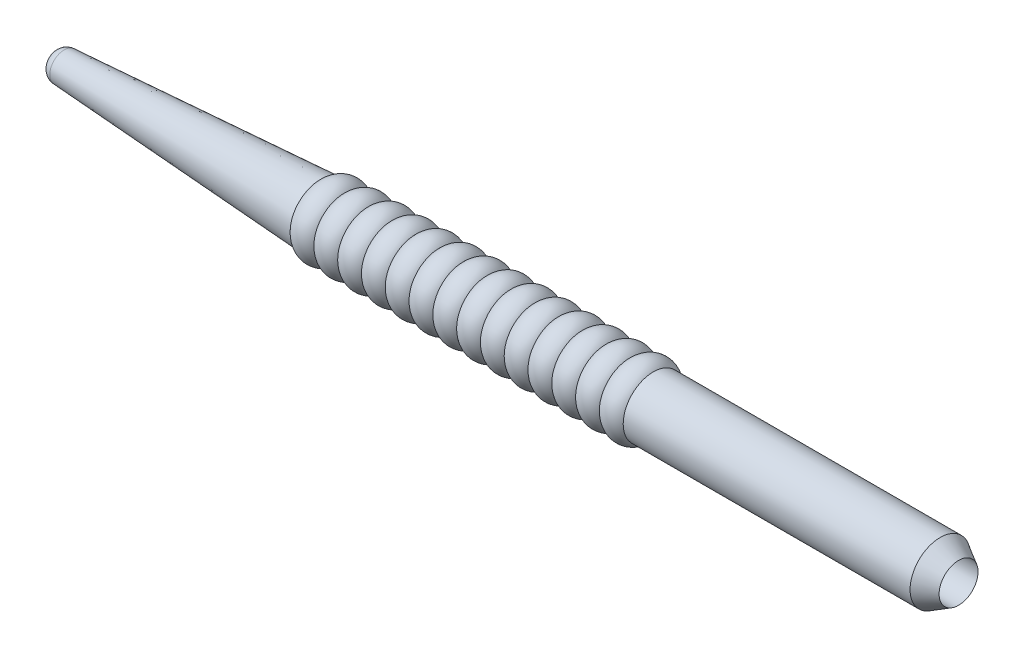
ISO-10303-21;
HEADER;
FILE_DESCRIPTION(('STEP AP214'),'2;1');
FILE_NAME('part.step','',(''),(''),'','','');
FILE_SCHEMA(('AUTOMOTIVE_DESIGN { 1 0 10303 214 1 1 1 1 }'));
ENDSEC;
DATA;
#1=APPLICATION_CONTEXT('core data for automotive mechanical design processes');
#2=APPLICATION_PROTOCOL_DEFINITION('international standard','automotive_design',2000,#1);
#3=PRODUCT_CONTEXT('',#1,'mechanical');
#4=PRODUCT('Part','Part','',(#3));
#5=PRODUCT_RELATED_PRODUCT_CATEGORY('part','',(#4));
#6=PRODUCT_DEFINITION_FORMATION('','',#4);
#7=PRODUCT_DEFINITION_CONTEXT('part definition',#1,'design');
#8=PRODUCT_DEFINITION('design','',#6,#7);
#9=PRODUCT_DEFINITION_SHAPE('','',#8);
#10=(LENGTH_UNIT() NAMED_UNIT(*) SI_UNIT(.MILLI.,.METRE.));
#11=(NAMED_UNIT(*) PLANE_ANGLE_UNIT() SI_UNIT($,.RADIAN.));
#12=(NAMED_UNIT(*) SI_UNIT($,.STERADIAN.) SOLID_ANGLE_UNIT());
#13=UNCERTAINTY_MEASURE_WITH_UNIT(LENGTH_MEASURE(1.E-05),#10,'distance_accuracy_value','');
#14=(GEOMETRIC_REPRESENTATION_CONTEXT(3) GLOBAL_UNCERTAINTY_ASSIGNED_CONTEXT((#13)) GLOBAL_UNIT_ASSIGNED_CONTEXT((#10,
#11,#12)) REPRESENTATION_CONTEXT('',''));
#15=CARTESIAN_POINT('',(0.,0.,0.));
#16=DIRECTION('',(0.,0.,1.));
#17=DIRECTION('',(1.,0.,0.));
#18=AXIS2_PLACEMENT_3D('',#15,#16,#17);
#19=CARTESIAN_POINT('',(1.99254615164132,0.,0.));
#20=DIRECTION('',(-1.,0.,0.));
#21=DIRECTION('',(0.,0.,1.));
#22=AXIS2_PLACEMENT_3D('',#19,#20,#21);
#23=DEGENERATE_TOROIDAL_SURFACE('',#22,0.721869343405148,1.99626959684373,.T.);
#24=CARTESIAN_POINT('',(0.,0.,0.));
#25=DIRECTION('',(-1.,0.,0.));
#26=DIRECTION('',(0.,0.,1.));
#27=AXIS2_PLACEMENT_3D('',#24,#25,#26);
#28=CIRCLE('',#27,0.6);
#29=CARTESIAN_POINT('',(0.,0.,-0.6));
#30=VERTEX_POINT('',#29);
#31=EDGE_CURVE('E53',#30,#30,#28,.T.);
#32=ORIENTED_EDGE('',*,*,#31,.F.);
#33=EDGE_LOOP('',(#32));
#34=FACE_BOUND('',#33,.T.);
#35=CARTESIAN_POINT('',(1.87067680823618,0.,0.));
#36=DIRECTION('',(-1.,0.,0.));
#37=DIRECTION('',(0.,0.,1.));
#38=AXIS2_PLACEMENT_3D('',#35,#36,#37);
#39=CIRCLE('',#38,2.71441549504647);
#40=CARTESIAN_POINT('',(1.87067680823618,0.,2.71441549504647));
#41=VERTEX_POINT('',#40);
#42=EDGE_CURVE('E10',#41,#41,#39,.T.);
#43=ORIENTED_EDGE('',*,*,#42,.T.);
#44=EDGE_LOOP('',(#43));
#45=FACE_BOUND('',#44,.T.);
#46=ADVANCED_FACE('F41',(#34,#45),#23,.T.);
#47=CARTESIAN_POINT('',(50.,0.,0.));
#48=DIRECTION('',(1.,0.,0.));
#49=DIRECTION('',(0.,0.,-1.));
#50=AXIS2_PLACEMENT_3D('',#47,#48,#49);
#51=CONICAL_SURFACE('',#50,5.65813100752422,0.0610865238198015);
#52=ORIENTED_EDGE('',*,*,#42,.F.);
#53=EDGE_LOOP('',(#52));
#54=FACE_BOUND('',#53,.T.);
#55=CARTESIAN_POINT('',(50.,0.,0.));
#56=DIRECTION('',(-1.,0.,0.));
#57=DIRECTION('',(0.,0.,1.));
#58=AXIS2_PLACEMENT_3D('',#55,#56,#57);
#59=CIRCLE('',#58,5.65813100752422);
#60=CARTESIAN_POINT('',(50.,0.,5.65813100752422));
#61=VERTEX_POINT('',#60);
#62=EDGE_CURVE('E172',#61,#61,#59,.T.);
#63=ORIENTED_EDGE('',*,*,#62,.T.);
#64=EDGE_LOOP('',(#63));
#65=FACE_BOUND('',#64,.T.);
#66=ADVANCED_FACE('F210',(#54,#65),#51,.T.);
#67=CARTESIAN_POINT('',(0.,0.,0.));
#68=DIRECTION('',(1.,0.,0.));
#69=DIRECTION('',(0.,0.,-1.));
#70=AXIS2_PLACEMENT_3D('',#67,#68,#69);
#71=CONICAL_SURFACE('',#70,0.6,0.0610865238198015);
#72=CARTESIAN_POINT('',(50.,0.,0.));
#73=DIRECTION('',(-1.,0.,0.));
#74=DIRECTION('',(0.,0.,1.));
#75=AXIS2_PLACEMENT_3D('',#72,#73,#74);
#76=CIRCLE('',#75,3.65813100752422);
#77=CARTESIAN_POINT('',(50.,0.,-3.65813100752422));
#78=VERTEX_POINT('',#77);
#79=EDGE_CURVE('E48',#78,#78,#76,.T.);
#80=CARTESIAN_POINT('',(50.,0.,-3.65813100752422));
#81=CARTESIAN_POINT('',(49.4791666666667,0.,-3.62627547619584));
#82=CARTESIAN_POINT('',(48.9583333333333,0.,-3.59441994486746));
#83=CARTESIAN_POINT('',(47.9166666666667,0.,-3.53070888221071));
#84=CARTESIAN_POINT('',(47.3958333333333,0.,-3.49885335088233));
#85=CARTESIAN_POINT('',(46.3541666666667,0.,-3.43514228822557));
#86=CARTESIAN_POINT('',(45.8333333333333,0.,-3.4032867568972));
#87=CARTESIAN_POINT('',(44.7916666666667,0.,-3.33957569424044));
#88=CARTESIAN_POINT('',(44.2708333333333,0.,-3.30772016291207));
#89=CARTESIAN_POINT('',(43.2291666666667,0.,-3.24400910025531));
#90=CARTESIAN_POINT('',(42.7083333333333,0.,-3.21215356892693));
#91=CARTESIAN_POINT('',(41.6666666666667,0.,-3.14844250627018));
#92=CARTESIAN_POINT('',(41.1458333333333,0.,-3.1165869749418));
#93=CARTESIAN_POINT('',(40.1041666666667,0.,-3.05287591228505));
#94=CARTESIAN_POINT('',(39.5833333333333,0.,-3.02102038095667));
#95=CARTESIAN_POINT('',(38.5416666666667,0.,-2.95730931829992));
#96=CARTESIAN_POINT('',(38.0208333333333,0.,-2.92545378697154));
#97=CARTESIAN_POINT('',(36.9791666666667,0.,-2.86174272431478));
#98=CARTESIAN_POINT('',(36.4583333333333,0.,-2.82988719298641));
#99=CARTESIAN_POINT('',(35.4166666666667,0.,-2.76617613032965));
#100=CARTESIAN_POINT('',(34.8958333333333,0.,-2.73432059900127));
#101=CARTESIAN_POINT('',(33.8541666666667,0.,-2.67060953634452));
#102=CARTESIAN_POINT('',(33.3333333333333,0.,-2.63875400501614));
#103=CARTESIAN_POINT('',(32.2916666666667,0.,-2.57504294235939));
#104=CARTESIAN_POINT('',(31.7708333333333,0.,-2.54318741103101));
#105=CARTESIAN_POINT('',(30.7291666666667,0.,-2.47947634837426));
#106=CARTESIAN_POINT('',(30.2083333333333,0.,-2.44762081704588));
#107=CARTESIAN_POINT('',(29.1666666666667,0.,-2.38390975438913));
#108=CARTESIAN_POINT('',(28.6458333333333,0.,-2.35205422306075));
#109=CARTESIAN_POINT('',(27.6041666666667,0.,-2.28834316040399));
#110=CARTESIAN_POINT('',(27.0833333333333,0.,-2.25648762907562));
#111=CARTESIAN_POINT('',(26.0416666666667,0.,-2.19277656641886));
#112=CARTESIAN_POINT('',(25.5208333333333,0.,-2.16092103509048));
#113=CARTESIAN_POINT('',(24.4791666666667,0.,-2.09720997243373));
#114=CARTESIAN_POINT('',(23.9583333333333,0.,-2.06535444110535));
#115=CARTESIAN_POINT('',(22.9166666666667,0.,-2.0016433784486));
#116=CARTESIAN_POINT('',(22.3958333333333,0.,-1.96978784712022));
#117=CARTESIAN_POINT('',(21.3541666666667,0.,-1.90607678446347));
#118=CARTESIAN_POINT('',(20.8333333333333,0.,-1.87422125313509));
#119=CARTESIAN_POINT('',(19.7916666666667,0.,-1.81051019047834));
#120=CARTESIAN_POINT('',(19.2708333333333,0.,-1.77865465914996));
#121=CARTESIAN_POINT('',(18.2291666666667,0.,-1.7149435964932));
#122=CARTESIAN_POINT('',(17.7083333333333,0.,-1.68308806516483));
#123=CARTESIAN_POINT('',(16.6666666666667,0.,-1.61937700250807));
#124=CARTESIAN_POINT('',(16.1458333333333,0.,-1.58752147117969));
#125=CARTESIAN_POINT('',(15.1041666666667,0.,-1.52381040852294));
#126=CARTESIAN_POINT('',(14.5833333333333,0.,-1.49195487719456));
#127=CARTESIAN_POINT('',(13.5416666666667,0.,-1.42824381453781));
#128=CARTESIAN_POINT('',(13.0208333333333,0.,-1.39638828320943));
#129=CARTESIAN_POINT('',(11.9791666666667,0.,-1.33267722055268));
#130=CARTESIAN_POINT('',(11.4583333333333,0.,-1.3008216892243));
#131=CARTESIAN_POINT('',(10.4166666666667,0.,-1.23711062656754));
#132=CARTESIAN_POINT('',(9.89583333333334,0.,-1.20525509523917));
#133=CARTESIAN_POINT('',(8.85416666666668,0.,-1.14154403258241));
#134=CARTESIAN_POINT('',(8.33333333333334,0.,-1.10968850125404));
#135=CARTESIAN_POINT('',(7.29166666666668,0.,-1.04597743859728));
#136=CARTESIAN_POINT('',(6.77083333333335,0.,-1.0141219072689));
#137=CARTESIAN_POINT('',(5.72916666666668,0.,-0.95041084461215));
#138=CARTESIAN_POINT('',(5.20833333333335,0.,-0.918555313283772));
#139=CARTESIAN_POINT('',(4.16666666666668,0.,-0.854844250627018));
#140=CARTESIAN_POINT('',(3.64583333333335,0.,-0.822988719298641));
#141=CARTESIAN_POINT('',(2.60416666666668,0.,-0.759277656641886));
#142=CARTESIAN_POINT('',(2.08333333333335,0.,-0.727422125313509));
#143=CARTESIAN_POINT('',(1.04166666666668,0.,-0.663711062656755));
#144=CARTESIAN_POINT('',(0.520833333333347,0.,-0.631855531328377));
#145=CARTESIAN_POINT('',(0.,0.,-0.6));
#146=B_SPLINE_CURVE_WITH_KNOTS('',3,(#80,#81,#82,#83,#84,#85,#86,#87,#88,#89,#90,#91,#92,#93,
#94,#95,#96,#97,#98,#99,#100,#101,#102,#103,#104,#105,#106,#107,#108,#109,#110,#111,#112,#113,
#114,#115,#116,#117,#118,#119,#120,#121,#122,#123,#124,#125,#126,#127,#128,#129,#130,#131,#132,
#133,#134,#135,#136,#137,#138,#139,#140,#141,#142,#143,#144,#145),.UNSPECIFIED.,.F.,.F.,(4,2,2,
2,2,2,2,2,2,2,2,2,2,2,2,2,2,2,2,2,2,2,2,2,2,2,2,2,2,2,2,2,4),(0.,1.56541982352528,
3.13083964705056,4.69625947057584,6.26167929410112,7.8270991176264,9.39251894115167,
10.957938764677,12.5233585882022,14.0887784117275,15.6541982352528,17.2196180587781,
18.7850378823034,20.3504577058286,21.9158775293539,23.4812973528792,25.0467171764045,
26.6121369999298,28.177556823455,29.7429766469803,31.3083964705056,32.8738162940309,
34.4392361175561,36.0046559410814,37.5700757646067,39.135495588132,40.7009154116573,
42.2663352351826,43.8317550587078,45.3971748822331,46.9625947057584,48.5280145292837,
50.0934343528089),.UNSPECIFIED.);
#147=EDGE_CURVE('BSEAM215',#78,#30,#146,.T.);
#148=ORIENTED_EDGE('',*,*,#79,.F.);
#149=ORIENTED_EDGE('',*,*,#31,.T.);
#150=ORIENTED_EDGE('',*,*,#147,.T.);
#151=ORIENTED_EDGE('',*,*,#147,.F.);
#152=EDGE_LOOP('',(#148,#150,#149,#151));
#153=FACE_BOUND('',#152,.T.);
#154=ADVANCED_FACE('F215',(#153),#71,.F.);
#155=CARTESIAN_POINT('',(52.2360679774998,0.,0.));
#156=DIRECTION('',(-1.,0.,0.));
#157=DIRECTION('',(0.,0.,1.));
#158=AXIS2_PLACEMENT_3D('',#155,#156,#157);
#159=TOROIDAL_SURFACE('',#158,5.65813100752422,3.);
#160=CARTESIAN_POINT('',(54.4721359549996,0.,0.));
#161=DIRECTION('',(-1.,0.,0.));
#162=DIRECTION('',(0.,0.,1.));
#163=AXIS2_PLACEMENT_3D('',#160,#161,#162);
#164=CIRCLE('',#163,3.65813100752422);
#165=CARTESIAN_POINT('',(54.4721359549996,0.,3.65813100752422));
#166=VERTEX_POINT('',#165);
#167=EDGE_CURVE('E58',#166,#166,#164,.T.);
#168=ORIENTED_EDGE('',*,*,#167,.F.);
#169=EDGE_LOOP('',(#168));
#170=FACE_BOUND('',#169,.T.);
#171=ORIENTED_EDGE('',*,*,#79,.T.);
#172=EDGE_LOOP('',(#171));
#173=FACE_BOUND('',#172,.T.);
#174=ADVANCED_FACE('F220',(#170,#173),#159,.T.);
#175=CARTESIAN_POINT('',(56.7082039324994,0.,0.));
#176=DIRECTION('',(-1.,0.,0.));
#177=DIRECTION('',(0.,0.,1.));
#178=AXIS2_PLACEMENT_3D('',#175,#176,#177);
#179=TOROIDAL_SURFACE('',#178,5.65813100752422,3.);
#180=CARTESIAN_POINT('',(58.9442719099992,0.,0.));
#181=DIRECTION('',(-1.,0.,0.));
#182=DIRECTION('',(0.,0.,1.));
#183=AXIS2_PLACEMENT_3D('',#180,#181,#182);
#184=CIRCLE('',#183,3.65813100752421);
#185=CARTESIAN_POINT('',(58.9442719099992,0.,3.65813100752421));
#186=VERTEX_POINT('',#185);
#187=EDGE_CURVE('E64',#186,#186,#184,.T.);
#188=ORIENTED_EDGE('',*,*,#187,.F.);
#189=EDGE_LOOP('',(#188));
#190=FACE_BOUND('',#189,.T.);
#191=ORIENTED_EDGE('',*,*,#167,.T.);
#192=EDGE_LOOP('',(#191));
#193=FACE_BOUND('',#192,.T.);
#194=ADVANCED_FACE('F226',(#190,#193),#179,.T.);
#195=CARTESIAN_POINT('',(61.180339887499,0.,0.));
#196=DIRECTION('',(-1.,0.,0.));
#197=DIRECTION('',(0.,0.,1.));
#198=AXIS2_PLACEMENT_3D('',#195,#196,#197);
#199=TOROIDAL_SURFACE('',#198,5.65813100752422,3.);
#200=CARTESIAN_POINT('',(63.4164078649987,0.,0.));
#201=DIRECTION('',(-1.,0.,0.));
#202=DIRECTION('',(0.,0.,1.));
#203=AXIS2_PLACEMENT_3D('',#200,#201,#202);
#204=CIRCLE('',#203,3.65813100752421);
#205=CARTESIAN_POINT('',(63.4164078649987,0.,3.65813100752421));
#206=VERTEX_POINT('',#205);
#207=EDGE_CURVE('E68',#206,#206,#204,.T.);
#208=ORIENTED_EDGE('',*,*,#207,.F.);
#209=EDGE_LOOP('',(#208));
#210=FACE_BOUND('',#209,.T.);
#211=ORIENTED_EDGE('',*,*,#187,.T.);
#212=EDGE_LOOP('',(#211));
#213=FACE_BOUND('',#212,.T.);
#214=ADVANCED_FACE('F232',(#210,#213),#199,.T.);
#215=CARTESIAN_POINT('',(65.6524758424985,0.,0.));
#216=DIRECTION('',(-1.,0.,0.));
#217=DIRECTION('',(0.,0.,1.));
#218=AXIS2_PLACEMENT_3D('',#215,#216,#217);
#219=TOROIDAL_SURFACE('',#218,5.65813100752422,3.);
#220=CARTESIAN_POINT('',(67.8885438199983,0.,0.));
#221=DIRECTION('',(-1.,0.,0.));
#222=DIRECTION('',(0.,0.,1.));
#223=AXIS2_PLACEMENT_3D('',#220,#221,#222);
#224=CIRCLE('',#223,3.65813100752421);
#225=CARTESIAN_POINT('',(67.8885438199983,0.,3.65813100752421));
#226=VERTEX_POINT('',#225);
#227=EDGE_CURVE('E72',#226,#226,#224,.T.);
#228=ORIENTED_EDGE('',*,*,#227,.F.);
#229=EDGE_LOOP('',(#228));
#230=FACE_BOUND('',#229,.T.);
#231=ORIENTED_EDGE('',*,*,#207,.T.);
#232=EDGE_LOOP('',(#231));
#233=FACE_BOUND('',#232,.T.);
#234=ADVANCED_FACE('F236',(#230,#233),#219,.T.);
#235=CARTESIAN_POINT('',(70.1246117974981,0.,0.));
#236=DIRECTION('',(-1.,0.,0.));
#237=DIRECTION('',(0.,0.,1.));
#238=AXIS2_PLACEMENT_3D('',#235,#236,#237);
#239=TOROIDAL_SURFACE('',#238,5.65813100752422,3.);
#240=CARTESIAN_POINT('',(72.3606797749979,0.,0.));
#241=DIRECTION('',(-1.,0.,0.));
#242=DIRECTION('',(0.,0.,1.));
#243=AXIS2_PLACEMENT_3D('',#240,#241,#242);
#244=CIRCLE('',#243,3.65813100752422);
#245=CARTESIAN_POINT('',(72.3606797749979,0.,3.65813100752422));
#246=VERTEX_POINT('',#245);
#247=EDGE_CURVE('E76',#246,#246,#244,.T.);
#248=ORIENTED_EDGE('',*,*,#247,.F.);
#249=EDGE_LOOP('',(#248));
#250=FACE_BOUND('',#249,.T.);
#251=ORIENTED_EDGE('',*,*,#227,.T.);
#252=EDGE_LOOP('',(#251));
#253=FACE_BOUND('',#252,.T.);
#254=ADVANCED_FACE('F240',(#250,#253),#239,.T.);
#255=CARTESIAN_POINT('',(74.5967477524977,0.,0.));
#256=DIRECTION('',(-1.,0.,0.));
#257=DIRECTION('',(0.,0.,1.));
#258=AXIS2_PLACEMENT_3D('',#255,#256,#257);
#259=TOROIDAL_SURFACE('',#258,5.65813100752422,3.);
#260=CARTESIAN_POINT('',(76.8328157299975,0.,0.));
#261=DIRECTION('',(-1.,0.,0.));
#262=DIRECTION('',(0.,0.,1.));
#263=AXIS2_PLACEMENT_3D('',#260,#261,#262);
#264=CIRCLE('',#263,3.65813100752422);
#265=CARTESIAN_POINT('',(76.8328157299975,0.,3.65813100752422));
#266=VERTEX_POINT('',#265);
#267=EDGE_CURVE('E80',#266,#266,#264,.T.);
#268=ORIENTED_EDGE('',*,*,#267,.F.);
#269=EDGE_LOOP('',(#268));
#270=FACE_BOUND('',#269,.T.);
#271=ORIENTED_EDGE('',*,*,#247,.T.);
#272=EDGE_LOOP('',(#271));
#273=FACE_BOUND('',#272,.T.);
#274=ADVANCED_FACE('F244',(#270,#273),#259,.T.);
#275=CARTESIAN_POINT('',(79.0688837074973,0.,0.));
#276=DIRECTION('',(-1.,0.,0.));
#277=DIRECTION('',(0.,0.,1.));
#278=AXIS2_PLACEMENT_3D('',#275,#276,#277);
#279=TOROIDAL_SURFACE('',#278,5.65813100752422,3.);
#280=CARTESIAN_POINT('',(81.3049516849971,0.,0.));
#281=DIRECTION('',(-1.,0.,0.));
#282=DIRECTION('',(0.,0.,1.));
#283=AXIS2_PLACEMENT_3D('',#280,#281,#282);
#284=CIRCLE('',#283,3.65813100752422);
#285=CARTESIAN_POINT('',(81.3049516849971,0.,3.65813100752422));
#286=VERTEX_POINT('',#285);
#287=EDGE_CURVE('E84',#286,#286,#284,.T.);
#288=ORIENTED_EDGE('',*,*,#287,.F.);
#289=EDGE_LOOP('',(#288));
#290=FACE_BOUND('',#289,.T.);
#291=ORIENTED_EDGE('',*,*,#267,.T.);
#292=EDGE_LOOP('',(#291));
#293=FACE_BOUND('',#292,.T.);
#294=ADVANCED_FACE('F248',(#290,#293),#279,.T.);
#295=CARTESIAN_POINT('',(83.5410196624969,0.,0.));
#296=DIRECTION('',(-1.,0.,0.));
#297=DIRECTION('',(0.,0.,1.));
#298=AXIS2_PLACEMENT_3D('',#295,#296,#297);
#299=TOROIDAL_SURFACE('',#298,5.65813100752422,3.);
#300=CARTESIAN_POINT('',(85.7770876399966,0.,0.));
#301=DIRECTION('',(-1.,0.,0.));
#302=DIRECTION('',(0.,0.,1.));
#303=AXIS2_PLACEMENT_3D('',#300,#301,#302);
#304=CIRCLE('',#303,3.65813100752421);
#305=CARTESIAN_POINT('',(85.7770876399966,0.,3.65813100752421));
#306=VERTEX_POINT('',#305);
#307=EDGE_CURVE('E88',#306,#306,#304,.T.);
#308=ORIENTED_EDGE('',*,*,#307,.F.);
#309=EDGE_LOOP('',(#308));
#310=FACE_BOUND('',#309,.T.);
#311=ORIENTED_EDGE('',*,*,#287,.T.);
#312=EDGE_LOOP('',(#311));
#313=FACE_BOUND('',#312,.T.);
#314=ADVANCED_FACE('F252',(#310,#313),#299,.T.);
#315=CARTESIAN_POINT('',(88.0131556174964,0.,0.));
#316=DIRECTION('',(-1.,0.,0.));
#317=DIRECTION('',(0.,0.,1.));
#318=AXIS2_PLACEMENT_3D('',#315,#316,#317);
#319=TOROIDAL_SURFACE('',#318,5.65813100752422,3.);
#320=CARTESIAN_POINT('',(90.2492235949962,0.,0.));
#321=DIRECTION('',(-1.,0.,0.));
#322=DIRECTION('',(0.,0.,1.));
#323=AXIS2_PLACEMENT_3D('',#320,#321,#322);
#324=CIRCLE('',#323,3.65813100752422);
#325=CARTESIAN_POINT('',(90.2492235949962,0.,3.65813100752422));
#326=VERTEX_POINT('',#325);
#327=EDGE_CURVE('E92',#326,#326,#324,.T.);
#328=ORIENTED_EDGE('',*,*,#327,.F.);
#329=EDGE_LOOP('',(#328));
#330=FACE_BOUND('',#329,.T.);
#331=ORIENTED_EDGE('',*,*,#307,.T.);
#332=EDGE_LOOP('',(#331));
#333=FACE_BOUND('',#332,.T.);
#334=ADVANCED_FACE('F256',(#330,#333),#319,.T.);
#335=CARTESIAN_POINT('',(92.485291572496,0.,0.));
#336=DIRECTION('',(-1.,0.,0.));
#337=DIRECTION('',(0.,0.,1.));
#338=AXIS2_PLACEMENT_3D('',#335,#336,#337);
#339=TOROIDAL_SURFACE('',#338,5.65813100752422,3.);
#340=CARTESIAN_POINT('',(94.7213595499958,0.,0.));
#341=DIRECTION('',(-1.,0.,0.));
#342=DIRECTION('',(0.,0.,1.));
#343=AXIS2_PLACEMENT_3D('',#340,#341,#342);
#344=CIRCLE('',#343,3.65813100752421);
#345=CARTESIAN_POINT('',(94.7213595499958,0.,3.65813100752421));
#346=VERTEX_POINT('',#345);
#347=EDGE_CURVE('E96',#346,#346,#344,.T.);
#348=ORIENTED_EDGE('',*,*,#347,.F.);
#349=EDGE_LOOP('',(#348));
#350=FACE_BOUND('',#349,.T.);
#351=ORIENTED_EDGE('',*,*,#327,.T.);
#352=EDGE_LOOP('',(#351));
#353=FACE_BOUND('',#352,.T.);
#354=ADVANCED_FACE('F260',(#350,#353),#339,.T.);
#355=CARTESIAN_POINT('',(96.9574275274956,0.,0.));
#356=DIRECTION('',(-1.,0.,0.));
#357=DIRECTION('',(0.,0.,1.));
#358=AXIS2_PLACEMENT_3D('',#355,#356,#357);
#359=TOROIDAL_SURFACE('',#358,5.65813100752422,3.);
#360=CARTESIAN_POINT('',(99.1934955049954,0.,0.));
#361=DIRECTION('',(-1.,0.,0.));
#362=DIRECTION('',(0.,0.,1.));
#363=AXIS2_PLACEMENT_3D('',#360,#361,#362);
#364=CIRCLE('',#363,3.65813100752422);
#365=CARTESIAN_POINT('',(99.1934955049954,0.,3.65813100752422));
#366=VERTEX_POINT('',#365);
#367=EDGE_CURVE('E100',#366,#366,#364,.T.);
#368=ORIENTED_EDGE('',*,*,#367,.F.);
#369=EDGE_LOOP('',(#368));
#370=FACE_BOUND('',#369,.T.);
#371=ORIENTED_EDGE('',*,*,#347,.T.);
#372=EDGE_LOOP('',(#371));
#373=FACE_BOUND('',#372,.T.);
#374=ADVANCED_FACE('F264',(#370,#373),#359,.T.);
#375=CARTESIAN_POINT('',(101.429563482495,0.,0.));
#376=DIRECTION('',(-1.,0.,0.));
#377=DIRECTION('',(0.,0.,1.));
#378=AXIS2_PLACEMENT_3D('',#375,#376,#377);
#379=TOROIDAL_SURFACE('',#378,5.65813100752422,2.99999999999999);
#380=CARTESIAN_POINT('',(103.665631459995,0.,0.));
#381=DIRECTION('',(-1.,0.,0.));
#382=DIRECTION('',(0.,0.,1.));
#383=AXIS2_PLACEMENT_3D('',#380,#381,#382);
#384=CIRCLE('',#383,3.65813100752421);
#385=CARTESIAN_POINT('',(103.665631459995,0.,3.65813100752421));
#386=VERTEX_POINT('',#385);
#387=EDGE_CURVE('E104',#386,#386,#384,.T.);
#388=ORIENTED_EDGE('',*,*,#387,.F.);
#389=EDGE_LOOP('',(#388));
#390=FACE_BOUND('',#389,.T.);
#391=ORIENTED_EDGE('',*,*,#367,.T.);
#392=EDGE_LOOP('',(#391));
#393=FACE_BOUND('',#392,.T.);
#394=ADVANCED_FACE('F268',(#390,#393),#379,.T.);
#395=CARTESIAN_POINT('',(105.901699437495,0.,0.));
#396=DIRECTION('',(-1.,0.,0.));
#397=DIRECTION('',(0.,0.,1.));
#398=AXIS2_PLACEMENT_3D('',#395,#396,#397);
#399=TOROIDAL_SURFACE('',#398,5.65813100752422,3.);
#400=CARTESIAN_POINT('',(108.137767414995,0.,0.));
#401=DIRECTION('',(-1.,0.,0.));
#402=DIRECTION('',(0.,0.,1.));
#403=AXIS2_PLACEMENT_3D('',#400,#401,#402);
#404=CIRCLE('',#403,3.65813100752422);
#405=CARTESIAN_POINT('',(108.137767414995,0.,3.65813100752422));
#406=VERTEX_POINT('',#405);
#407=EDGE_CURVE('E108',#406,#406,#404,.T.);
#408=ORIENTED_EDGE('',*,*,#407,.F.);
#409=EDGE_LOOP('',(#408));
#410=FACE_BOUND('',#409,.T.);
#411=ORIENTED_EDGE('',*,*,#387,.T.);
#412=EDGE_LOOP('',(#411));
#413=FACE_BOUND('',#412,.T.);
#414=ADVANCED_FACE('F206',(#410,#413),#399,.T.);
#415=CARTESIAN_POINT('',(110.373835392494,0.,0.));
#416=DIRECTION('',(-1.,0.,0.));
#417=DIRECTION('',(0.,0.,1.));
#418=AXIS2_PLACEMENT_3D('',#415,#416,#417);
#419=TOROIDAL_SURFACE('',#418,5.65813100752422,3.);
#420=CARTESIAN_POINT('',(112.609903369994,0.,0.));
#421=DIRECTION('',(-1.,0.,0.));
#422=DIRECTION('',(0.,0.,1.));
#423=AXIS2_PLACEMENT_3D('',#420,#421,#422);
#424=CIRCLE('',#423,3.65813100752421);
#425=CARTESIAN_POINT('',(112.609903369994,0.,3.65813100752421));
#426=VERTEX_POINT('',#425);
#427=EDGE_CURVE('E112',#426,#426,#424,.T.);
#428=ORIENTED_EDGE('',*,*,#427,.F.);
#429=EDGE_LOOP('',(#428));
#430=FACE_BOUND('',#429,.T.);
#431=ORIENTED_EDGE('',*,*,#407,.T.);
#432=EDGE_LOOP('',(#431));
#433=FACE_BOUND('',#432,.T.);
#434=ADVANCED_FACE('F196',(#430,#433),#419,.T.);
#435=CARTESIAN_POINT('',(21.0247582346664,0.,0.));
#436=DIRECTION('',(-1.,0.,0.));
#437=DIRECTION('',(0.,0.,1.));
#438=AXIS2_PLACEMENT_3D('',#435,#436,#437);
#439=CYLINDRICAL_SURFACE('',#438,3.65813100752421);
#440=ORIENTED_EDGE('',*,*,#427,.T.);
#441=EDGE_LOOP('',(#440));
#442=FACE_BOUND('',#441,.T.);
#443=CARTESIAN_POINT('',(170.,0.,0.));
#444=DIRECTION('',(-1.,0.,0.));
#445=DIRECTION('',(0.,0.,1.));
#446=AXIS2_PLACEMENT_3D('',#443,#444,#445);
#447=CIRCLE('',#446,3.65813100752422);
#448=CARTESIAN_POINT('',(170.,0.,3.65813100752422));
#449=VERTEX_POINT('',#448);
#450=EDGE_CURVE('E176',#449,#449,#447,.T.);
#451=ORIENTED_EDGE('',*,*,#450,.F.);
#452=EDGE_LOOP('',(#451));
#453=FACE_BOUND('',#452,.T.);
#454=ADVANCED_FACE('F194',(#442,#453),#439,.F.);
#455=CARTESIAN_POINT('',(21.0247582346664,0.,0.));
#456=DIRECTION('',(-1.,0.,0.));
#457=DIRECTION('',(0.,0.,1.));
#458=AXIS2_PLACEMENT_3D('',#455,#456,#457);
#459=CYLINDRICAL_SURFACE('',#458,5.65813100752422);
#460=CARTESIAN_POINT('',(112.609903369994,0.,0.));
#461=DIRECTION('',(-1.,0.,0.));
#462=DIRECTION('',(0.,0.,1.));
#463=AXIS2_PLACEMENT_3D('',#460,#461,#462);
#464=CIRCLE('',#463,5.65813100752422);
#465=CARTESIAN_POINT('',(112.609903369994,0.,5.65813100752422));
#466=VERTEX_POINT('',#465);
#467=EDGE_CURVE('E116',#466,#466,#464,.T.);
#468=ORIENTED_EDGE('',*,*,#467,.F.);
#469=EDGE_LOOP('',(#468));
#470=FACE_BOUND('',#469,.T.);
#471=CARTESIAN_POINT('',(166.535898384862,0.,0.));
#472=DIRECTION('',(-1.,0.,0.));
#473=DIRECTION('',(0.,0.,1.));
#474=AXIS2_PLACEMENT_3D('',#471,#472,#473);
#475=CIRCLE('',#474,5.65813100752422);
#476=CARTESIAN_POINT('',(166.535898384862,0.,5.65813100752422));
#477=VERTEX_POINT('',#476);
#478=EDGE_CURVE('E180',#477,#477,#475,.T.);
#479=ORIENTED_EDGE('',*,*,#478,.T.);
#480=EDGE_LOOP('',(#479));
#481=FACE_BOUND('',#480,.T.);
#482=ADVANCED_FACE('F185',(#470,#481),#459,.T.);
#483=CARTESIAN_POINT('',(110.373835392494,0.,0.));
#484=DIRECTION('',(-1.,0.,0.));
#485=DIRECTION('',(0.,0.,1.));
#486=AXIS2_PLACEMENT_3D('',#483,#484,#485);
#487=TOROIDAL_SURFACE('',#486,3.65813100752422,3.);
#488=CARTESIAN_POINT('',(108.137767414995,0.,0.));
#489=DIRECTION('',(-1.,0.,0.));
#490=DIRECTION('',(0.,0.,1.));
#491=AXIS2_PLACEMENT_3D('',#488,#489,#490);
#492=CIRCLE('',#491,5.65813100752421);
#493=CARTESIAN_POINT('',(108.137767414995,0.,5.65813100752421));
#494=VERTEX_POINT('',#493);
#495=EDGE_CURVE('E120',#494,#494,#492,.T.);
#496=ORIENTED_EDGE('',*,*,#495,.F.);
#497=EDGE_LOOP('',(#496));
#498=FACE_BOUND('',#497,.T.);
#499=ORIENTED_EDGE('',*,*,#467,.T.);
#500=EDGE_LOOP('',(#499));
#501=FACE_BOUND('',#500,.T.);
#502=ADVANCED_FACE('F203',(#498,#501),#487,.T.);
#503=CARTESIAN_POINT('',(105.901699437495,0.,0.));
#504=DIRECTION('',(-1.,0.,0.));
#505=DIRECTION('',(0.,0.,1.));
#506=AXIS2_PLACEMENT_3D('',#503,#504,#505);
#507=TOROIDAL_SURFACE('',#506,3.65813100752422,3.);
#508=CARTESIAN_POINT('',(103.665631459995,0.,0.));
#509=DIRECTION('',(-1.,0.,0.));
#510=DIRECTION('',(0.,0.,1.));
#511=AXIS2_PLACEMENT_3D('',#508,#509,#510);
#512=CIRCLE('',#511,5.65813100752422);
#513=CARTESIAN_POINT('',(103.665631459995,0.,5.65813100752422));
#514=VERTEX_POINT('',#513);
#515=EDGE_CURVE('E124',#514,#514,#512,.T.);
#516=ORIENTED_EDGE('',*,*,#515,.F.);
#517=EDGE_LOOP('',(#516));
#518=FACE_BOUND('',#517,.T.);
#519=ORIENTED_EDGE('',*,*,#495,.T.);
#520=EDGE_LOOP('',(#519));
#521=FACE_BOUND('',#520,.T.);
#522=ADVANCED_FACE('F320',(#518,#521),#507,.T.);
#523=CARTESIAN_POINT('',(101.429563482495,0.,0.));
#524=DIRECTION('',(-1.,0.,0.));
#525=DIRECTION('',(0.,0.,1.));
#526=AXIS2_PLACEMENT_3D('',#523,#524,#525);
#527=TOROIDAL_SURFACE('',#526,3.65813100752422,3.00000000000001);
#528=CARTESIAN_POINT('',(99.1934955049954,0.,0.));
#529=DIRECTION('',(-1.,0.,0.));
#530=DIRECTION('',(0.,0.,1.));
#531=AXIS2_PLACEMENT_3D('',#528,#529,#530);
#532=CIRCLE('',#531,5.65813100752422);
#533=CARTESIAN_POINT('',(99.1934955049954,0.,5.65813100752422));
#534=VERTEX_POINT('',#533);
#535=EDGE_CURVE('E128',#534,#534,#532,.T.);
#536=ORIENTED_EDGE('',*,*,#535,.F.);
#537=EDGE_LOOP('',(#536));
#538=FACE_BOUND('',#537,.T.);
#539=ORIENTED_EDGE('',*,*,#515,.T.);
#540=EDGE_LOOP('',(#539));
#541=FACE_BOUND('',#540,.T.);
#542=ADVANCED_FACE('F332',(#538,#541),#527,.T.);
#543=CARTESIAN_POINT('',(96.9574275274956,0.,0.));
#544=DIRECTION('',(-1.,0.,0.));
#545=DIRECTION('',(0.,0.,1.));
#546=AXIS2_PLACEMENT_3D('',#543,#544,#545);
#547=TOROIDAL_SURFACE('',#546,3.65813100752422,3.);
#548=CARTESIAN_POINT('',(94.7213595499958,0.,0.));
#549=DIRECTION('',(-1.,0.,0.));
#550=DIRECTION('',(0.,0.,1.));
#551=AXIS2_PLACEMENT_3D('',#548,#549,#550);
#552=CIRCLE('',#551,5.65813100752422);
#553=CARTESIAN_POINT('',(94.7213595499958,0.,5.65813100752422));
#554=VERTEX_POINT('',#553);
#555=EDGE_CURVE('E132',#554,#554,#552,.T.);
#556=ORIENTED_EDGE('',*,*,#555,.F.);
#557=EDGE_LOOP('',(#556));
#558=FACE_BOUND('',#557,.T.);
#559=ORIENTED_EDGE('',*,*,#535,.T.);
#560=EDGE_LOOP('',(#559));
#561=FACE_BOUND('',#560,.T.);
#562=ADVANCED_FACE('F343',(#558,#561),#547,.T.);
#563=CARTESIAN_POINT('',(92.485291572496,0.,0.));
#564=DIRECTION('',(-1.,0.,0.));
#565=DIRECTION('',(0.,0.,1.));
#566=AXIS2_PLACEMENT_3D('',#563,#564,#565);
#567=TOROIDAL_SURFACE('',#566,3.65813100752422,3.00000000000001);
#568=CARTESIAN_POINT('',(90.2492235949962,0.,0.));
#569=DIRECTION('',(-1.,0.,0.));
#570=DIRECTION('',(0.,0.,1.));
#571=AXIS2_PLACEMENT_3D('',#568,#569,#570);
#572=CIRCLE('',#571,5.65813100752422);
#573=CARTESIAN_POINT('',(90.2492235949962,0.,5.65813100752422));
#574=VERTEX_POINT('',#573);
#575=EDGE_CURVE('E136',#574,#574,#572,.T.);
#576=ORIENTED_EDGE('',*,*,#575,.F.);
#577=EDGE_LOOP('',(#576));
#578=FACE_BOUND('',#577,.T.);
#579=ORIENTED_EDGE('',*,*,#555,.T.);
#580=EDGE_LOOP('',(#579));
#581=FACE_BOUND('',#580,.T.);
#582=ADVANCED_FACE('F354',(#578,#581),#567,.T.);
#583=CARTESIAN_POINT('',(88.0131556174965,0.,0.));
#584=DIRECTION('',(-1.,0.,0.));
#585=DIRECTION('',(0.,0.,1.));
#586=AXIS2_PLACEMENT_3D('',#583,#584,#585);
#587=TOROIDAL_SURFACE('',#586,3.65813100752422,3.);
#588=CARTESIAN_POINT('',(85.7770876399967,0.,0.));
#589=DIRECTION('',(-1.,0.,0.));
#590=DIRECTION('',(0.,0.,1.));
#591=AXIS2_PLACEMENT_3D('',#588,#589,#590);
#592=CIRCLE('',#591,5.65813100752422);
#593=CARTESIAN_POINT('',(85.7770876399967,0.,5.65813100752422));
#594=VERTEX_POINT('',#593);
#595=EDGE_CURVE('E140',#594,#594,#592,.T.);
#596=ORIENTED_EDGE('',*,*,#595,.F.);
#597=EDGE_LOOP('',(#596));
#598=FACE_BOUND('',#597,.T.);
#599=ORIENTED_EDGE('',*,*,#575,.T.);
#600=EDGE_LOOP('',(#599));
#601=FACE_BOUND('',#600,.T.);
#602=ADVANCED_FACE('F365',(#598,#601),#587,.T.);
#603=CARTESIAN_POINT('',(83.5410196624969,0.,0.));
#604=DIRECTION('',(-1.,0.,0.));
#605=DIRECTION('',(0.,0.,1.));
#606=AXIS2_PLACEMENT_3D('',#603,#604,#605);
#607=TOROIDAL_SURFACE('',#606,3.65813100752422,3.00000000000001);
#608=CARTESIAN_POINT('',(81.3049516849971,0.,0.));
#609=DIRECTION('',(-1.,0.,0.));
#610=DIRECTION('',(0.,0.,1.));
#611=AXIS2_PLACEMENT_3D('',#608,#609,#610);
#612=CIRCLE('',#611,5.65813100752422);
#613=CARTESIAN_POINT('',(81.3049516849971,0.,5.65813100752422));
#614=VERTEX_POINT('',#613);
#615=EDGE_CURVE('E144',#614,#614,#612,.T.);
#616=ORIENTED_EDGE('',*,*,#615,.F.);
#617=EDGE_LOOP('',(#616));
#618=FACE_BOUND('',#617,.T.);
#619=ORIENTED_EDGE('',*,*,#595,.T.);
#620=EDGE_LOOP('',(#619));
#621=FACE_BOUND('',#620,.T.);
#622=ADVANCED_FACE('F376',(#618,#621),#607,.T.);
#623=CARTESIAN_POINT('',(79.0688837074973,0.,0.));
#624=DIRECTION('',(-1.,0.,0.));
#625=DIRECTION('',(0.,0.,1.));
#626=AXIS2_PLACEMENT_3D('',#623,#624,#625);
#627=TOROIDAL_SURFACE('',#626,3.65813100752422,3.);
#628=CARTESIAN_POINT('',(76.8328157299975,0.,0.));
#629=DIRECTION('',(-1.,0.,0.));
#630=DIRECTION('',(0.,0.,1.));
#631=AXIS2_PLACEMENT_3D('',#628,#629,#630);
#632=CIRCLE('',#631,5.65813100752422);
#633=CARTESIAN_POINT('',(76.8328157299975,0.,5.65813100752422));
#634=VERTEX_POINT('',#633);
#635=EDGE_CURVE('E148',#634,#634,#632,.T.);
#636=ORIENTED_EDGE('',*,*,#635,.F.);
#637=EDGE_LOOP('',(#636));
#638=FACE_BOUND('',#637,.T.);
#639=ORIENTED_EDGE('',*,*,#615,.T.);
#640=EDGE_LOOP('',(#639));
#641=FACE_BOUND('',#640,.T.);
#642=ADVANCED_FACE('F387',(#638,#641),#627,.T.);
#643=CARTESIAN_POINT('',(74.5967477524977,0.,0.));
#644=DIRECTION('',(-1.,0.,0.));
#645=DIRECTION('',(0.,0.,1.));
#646=AXIS2_PLACEMENT_3D('',#643,#644,#645);
#647=TOROIDAL_SURFACE('',#646,3.65813100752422,3.);
#648=CARTESIAN_POINT('',(72.3606797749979,0.,0.));
#649=DIRECTION('',(-1.,0.,0.));
#650=DIRECTION('',(0.,0.,1.));
#651=AXIS2_PLACEMENT_3D('',#648,#649,#650);
#652=CIRCLE('',#651,5.65813100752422);
#653=CARTESIAN_POINT('',(72.3606797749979,0.,5.65813100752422));
#654=VERTEX_POINT('',#653);
#655=EDGE_CURVE('E152',#654,#654,#652,.T.);
#656=ORIENTED_EDGE('',*,*,#655,.F.);
#657=EDGE_LOOP('',(#656));
#658=FACE_BOUND('',#657,.T.);
#659=ORIENTED_EDGE('',*,*,#635,.T.);
#660=EDGE_LOOP('',(#659));
#661=FACE_BOUND('',#660,.T.);
#662=ADVANCED_FACE('F398',(#658,#661),#647,.T.);
#663=CARTESIAN_POINT('',(70.1246117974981,0.,0.));
#664=DIRECTION('',(-1.,0.,0.));
#665=DIRECTION('',(0.,0.,1.));
#666=AXIS2_PLACEMENT_3D('',#663,#664,#665);
#667=TOROIDAL_SURFACE('',#666,3.65813100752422,3.);
#668=CARTESIAN_POINT('',(67.8885438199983,0.,0.));
#669=DIRECTION('',(-1.,0.,0.));
#670=DIRECTION('',(0.,0.,1.));
#671=AXIS2_PLACEMENT_3D('',#668,#669,#670);
#672=CIRCLE('',#671,5.65813100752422);
#673=CARTESIAN_POINT('',(67.8885438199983,0.,5.65813100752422));
#674=VERTEX_POINT('',#673);
#675=EDGE_CURVE('E156',#674,#674,#672,.T.);
#676=ORIENTED_EDGE('',*,*,#675,.F.);
#677=EDGE_LOOP('',(#676));
#678=FACE_BOUND('',#677,.T.);
#679=ORIENTED_EDGE('',*,*,#655,.T.);
#680=EDGE_LOOP('',(#679));
#681=FACE_BOUND('',#680,.T.);
#682=ADVANCED_FACE('F409',(#678,#681),#667,.T.);
#683=CARTESIAN_POINT('',(65.6524758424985,0.,0.));
#684=DIRECTION('',(-1.,0.,0.));
#685=DIRECTION('',(0.,0.,1.));
#686=AXIS2_PLACEMENT_3D('',#683,#684,#685);
#687=TOROIDAL_SURFACE('',#686,3.65813100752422,3.);
#688=CARTESIAN_POINT('',(63.4164078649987,0.,0.));
#689=DIRECTION('',(-1.,0.,0.));
#690=DIRECTION('',(0.,0.,1.));
#691=AXIS2_PLACEMENT_3D('',#688,#689,#690);
#692=CIRCLE('',#691,5.65813100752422);
#693=CARTESIAN_POINT('',(63.4164078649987,0.,5.65813100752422));
#694=VERTEX_POINT('',#693);
#695=EDGE_CURVE('E160',#694,#694,#692,.T.);
#696=ORIENTED_EDGE('',*,*,#695,.F.);
#697=EDGE_LOOP('',(#696));
#698=FACE_BOUND('',#697,.T.);
#699=ORIENTED_EDGE('',*,*,#675,.T.);
#700=EDGE_LOOP('',(#699));
#701=FACE_BOUND('',#700,.T.);
#702=ADVANCED_FACE('F420',(#698,#701),#687,.T.);
#703=CARTESIAN_POINT('',(61.180339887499,0.,0.));
#704=DIRECTION('',(-1.,0.,0.));
#705=DIRECTION('',(0.,0.,1.));
#706=AXIS2_PLACEMENT_3D('',#703,#704,#705);
#707=TOROIDAL_SURFACE('',#706,3.65813100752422,3.);
#708=CARTESIAN_POINT('',(58.9442719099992,0.,0.));
#709=DIRECTION('',(-1.,0.,0.));
#710=DIRECTION('',(0.,0.,1.));
#711=AXIS2_PLACEMENT_3D('',#708,#709,#710);
#712=CIRCLE('',#711,5.65813100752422);
#713=CARTESIAN_POINT('',(58.9442719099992,0.,5.65813100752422));
#714=VERTEX_POINT('',#713);
#715=EDGE_CURVE('E164',#714,#714,#712,.T.);
#716=ORIENTED_EDGE('',*,*,#715,.F.);
#717=EDGE_LOOP('',(#716));
#718=FACE_BOUND('',#717,.T.);
#719=ORIENTED_EDGE('',*,*,#695,.T.);
#720=EDGE_LOOP('',(#719));
#721=FACE_BOUND('',#720,.T.);
#722=ADVANCED_FACE('F431',(#718,#721),#707,.T.);
#723=CARTESIAN_POINT('',(56.7082039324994,0.,0.));
#724=DIRECTION('',(-1.,0.,0.));
#725=DIRECTION('',(0.,0.,1.));
#726=AXIS2_PLACEMENT_3D('',#723,#724,#725);
#727=TOROIDAL_SURFACE('',#726,3.65813100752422,3.);
#728=CARTESIAN_POINT('',(54.4721359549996,0.,0.));
#729=DIRECTION('',(-1.,0.,0.));
#730=DIRECTION('',(0.,0.,1.));
#731=AXIS2_PLACEMENT_3D('',#728,#729,#730);
#732=CIRCLE('',#731,5.65813100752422);
#733=CARTESIAN_POINT('',(54.4721359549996,0.,5.65813100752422));
#734=VERTEX_POINT('',#733);
#735=EDGE_CURVE('E168',#734,#734,#732,.T.);
#736=ORIENTED_EDGE('',*,*,#735,.F.);
#737=EDGE_LOOP('',(#736));
#738=FACE_BOUND('',#737,.T.);
#739=ORIENTED_EDGE('',*,*,#715,.T.);
#740=EDGE_LOOP('',(#739));
#741=FACE_BOUND('',#740,.T.);
#742=ADVANCED_FACE('F442',(#738,#741),#727,.T.);
#743=CARTESIAN_POINT('',(52.2360679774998,0.,0.));
#744=DIRECTION('',(-1.,0.,0.));
#745=DIRECTION('',(0.,0.,1.));
#746=AXIS2_PLACEMENT_3D('',#743,#744,#745);
#747=TOROIDAL_SURFACE('',#746,3.65813100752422,3.);
#748=ORIENTED_EDGE('',*,*,#62,.F.);
#749=EDGE_LOOP('',(#748));
#750=FACE_BOUND('',#749,.T.);
#751=ORIENTED_EDGE('',*,*,#735,.T.);
#752=EDGE_LOOP('',(#751));
#753=FACE_BOUND('',#752,.T.);
#754=ADVANCED_FACE('F190',(#750,#753),#747,.T.);
#755=CARTESIAN_POINT('',(170.,0.,0.));
#756=DIRECTION('',(-1.,0.,0.));
#757=DIRECTION('',(0.,0.,1.));
#758=AXIS2_PLACEMENT_3D('',#755,#756,#757);
#759=CONICAL_SURFACE('',#758,3.65813100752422,0.5235987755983);
#760=ORIENTED_EDGE('',*,*,#478,.F.);
#761=EDGE_LOOP('',(#760));
#762=FACE_BOUND('',#761,.T.);
#763=ORIENTED_EDGE('',*,*,#450,.T.);
#764=EDGE_LOOP('',(#763));
#765=FACE_BOUND('',#764,.T.);
#766=ADVANCED_FACE('F187',(#762,#765),#759,.T.);
#767=CLOSED_SHELL('',(#46,#66,#154,#174,#194,#214,#234,#254,#274,#294,#314,#334,#354,#374,#394,
#414,#434,#454,#482,#502,#522,#542,#562,#582,#602,#622,#642,#662,#682,#702,#722,#742,#754,#766));
#768=MANIFOLD_SOLID_BREP('B2',#767);
#769=ADVANCED_BREP_SHAPE_REPRESENTATION('',(#18,#768),#14);
#770=SHAPE_DEFINITION_REPRESENTATION(#9,#769);
ENDSEC;
END-ISO-10303-21;
